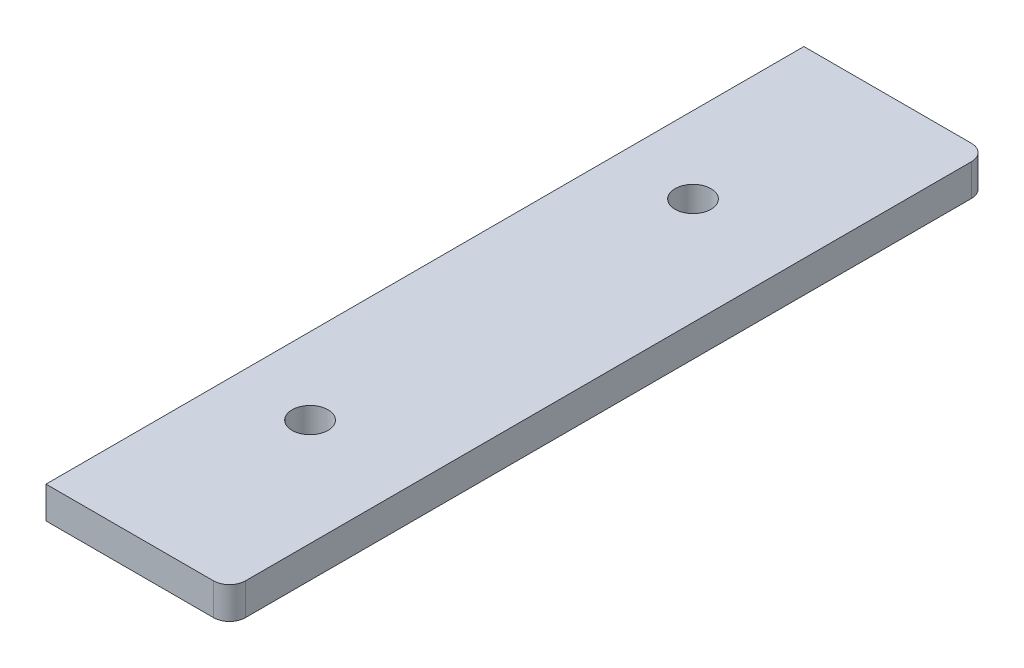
ISO-10303-21;
HEADER;
FILE_DESCRIPTION(('STEP AP214'),'2;1');
FILE_NAME('part.step','',(''),(''),'','','');
FILE_SCHEMA(('AUTOMOTIVE_DESIGN { 1 0 10303 214 1 1 1 1 }'));
ENDSEC;
DATA;
#1=APPLICATION_CONTEXT('core data for automotive mechanical design processes');
#2=APPLICATION_PROTOCOL_DEFINITION('international standard','automotive_design',2000,#1);
#3=PRODUCT_CONTEXT('',#1,'mechanical');
#4=PRODUCT('Part','Part','',(#3));
#5=PRODUCT_RELATED_PRODUCT_CATEGORY('part','',(#4));
#6=PRODUCT_DEFINITION_FORMATION('','',#4);
#7=PRODUCT_DEFINITION_CONTEXT('part definition',#1,'design');
#8=PRODUCT_DEFINITION('design','',#6,#7);
#9=PRODUCT_DEFINITION_SHAPE('','',#8);
#10=(LENGTH_UNIT() NAMED_UNIT(*) SI_UNIT(.MILLI.,.METRE.));
#11=(NAMED_UNIT(*) PLANE_ANGLE_UNIT() SI_UNIT($,.RADIAN.));
#12=(NAMED_UNIT(*) SI_UNIT($,.STERADIAN.) SOLID_ANGLE_UNIT());
#13=UNCERTAINTY_MEASURE_WITH_UNIT(LENGTH_MEASURE(1.E-05),#10,'distance_accuracy_value','');
#14=(GEOMETRIC_REPRESENTATION_CONTEXT(3) GLOBAL_UNCERTAINTY_ASSIGNED_CONTEXT((#13)) GLOBAL_UNIT_ASSIGNED_CONTEXT((#10,
#11,#12)) REPRESENTATION_CONTEXT('',''));
#15=CARTESIAN_POINT('',(0.,0.,0.));
#16=DIRECTION('',(0.,0.,1.));
#17=DIRECTION('',(1.,0.,0.));
#18=AXIS2_PLACEMENT_3D('',#15,#16,#17);
#19=CARTESIAN_POINT('',(0.,6.35,0.));
#20=DIRECTION('',(0.,-1.,0.));
#21=DIRECTION('',(0.,0.,-1.));
#22=AXIS2_PLACEMENT_3D('',#19,#20,#21);
#23=PLANE('',#22);
#24=DIRECTION('',(1.,0.,0.));
#25=VECTOR('',#24,1.);
#26=CARTESIAN_POINT('',(-18.25625,6.35,75.40625));
#27=LINE('',#26,#25);
#28=CARTESIAN_POINT('',(-18.25625,6.35,75.40625));
#29=VERTEX_POINT('',#28);
#30=CARTESIAN_POINT('',(15.08125,6.35,75.40625));
#31=VERTEX_POINT('',#30);
#32=EDGE_CURVE('E140',#29,#31,#27,.T.);
#33=ORIENTED_EDGE('',*,*,#32,.T.);
#34=CARTESIAN_POINT('',(15.08125,6.35,72.23125));
#35=DIRECTION('',(0.,-1.,0.));
#36=DIRECTION('',(0.,0.,-1.));
#37=AXIS2_PLACEMENT_3D('',#34,#35,#36);
#38=CIRCLE('',#37,3.175);
#39=CARTESIAN_POINT('',(18.25625,6.35,72.23125));
#40=VERTEX_POINT('',#39);
#41=EDGE_CURVE('E58',#31,#40,#38,.F.);
#42=ORIENTED_EDGE('',*,*,#41,.T.);
#43=DIRECTION('',(0.,0.,-1.));
#44=VECTOR('',#43,1.);
#45=CARTESIAN_POINT('',(18.25625,6.35,75.40625));
#46=LINE('',#45,#44);
#47=CARTESIAN_POINT('',(18.25625,6.35,-72.23125));
#48=VERTEX_POINT('',#47);
#49=EDGE_CURVE('E124',#40,#48,#46,.T.);
#50=ORIENTED_EDGE('',*,*,#49,.T.);
#51=CARTESIAN_POINT('',(15.08125,6.35,-72.23125));
#52=DIRECTION('',(0.,-1.,0.));
#53=DIRECTION('',(0.,0.,-1.));
#54=AXIS2_PLACEMENT_3D('',#51,#52,#53);
#55=CIRCLE('',#54,3.175);
#56=CARTESIAN_POINT('',(15.08125,6.35,-75.40625));
#57=VERTEX_POINT('',#56);
#58=EDGE_CURVE('E68',#48,#57,#55,.F.);
#59=ORIENTED_EDGE('',*,*,#58,.T.);
#60=DIRECTION('',(-1.,0.,0.));
#61=VECTOR('',#60,1.);
#62=CARTESIAN_POINT('',(-18.25625,6.35,-75.40625));
#63=LINE('',#62,#61);
#64=CARTESIAN_POINT('',(-18.25625,6.35,-75.40625));
#65=VERTEX_POINT('',#64);
#66=EDGE_CURVE('E115',#57,#65,#63,.T.);
#67=ORIENTED_EDGE('',*,*,#66,.T.);
#68=DIRECTION('',(0.,0.,1.));
#69=VECTOR('',#68,1.);
#70=CARTESIAN_POINT('',(-18.25625,6.35,75.40625));
#71=LINE('',#70,#69);
#72=EDGE_CURVE('E119',#65,#29,#71,.T.);
#73=ORIENTED_EDGE('',*,*,#72,.T.);
#74=EDGE_LOOP('',(#33,#42,#50,#59,#67,#73));
#75=FACE_BOUND('',#74,.T.);
#76=CARTESIAN_POINT('',(-3.01625000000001,6.35,-38.1));
#77=DIRECTION('',(0.,1.,0.));
#78=DIRECTION('',(0.,0.,1.));
#79=AXIS2_PLACEMENT_3D('',#76,#77,#78);
#80=CIRCLE('',#79,3.571875);
#81=CARTESIAN_POINT('',(-3.01625000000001,6.35,-34.528125));
#82=VERTEX_POINT('',#81);
#83=EDGE_CURVE('E152',#82,#82,#80,.T.);
#84=ORIENTED_EDGE('',*,*,#83,.F.);
#85=EDGE_LOOP('',(#84));
#86=FACE_BOUND('',#85,.T.);
#87=CARTESIAN_POINT('',(-3.01625,6.35,38.1));
#88=DIRECTION('',(0.,1.,0.));
#89=DIRECTION('',(0.,0.,1.));
#90=AXIS2_PLACEMENT_3D('',#87,#88,#89);
#91=CIRCLE('',#90,3.571875);
#92=CARTESIAN_POINT('',(-3.01625,6.35,41.671875));
#93=VERTEX_POINT('',#92);
#94=EDGE_CURVE('E219',#93,#93,#91,.T.);
#95=ORIENTED_EDGE('',*,*,#94,.F.);
#96=EDGE_LOOP('',(#95));
#97=FACE_BOUND('',#96,.T.);
#98=ADVANCED_FACE('F49',(#75,#86,#97),#23,.F.);
#99=CARTESIAN_POINT('',(0.,0.,0.));
#100=DIRECTION('',(0.,-1.,0.));
#101=DIRECTION('',(0.,0.,-1.));
#102=AXIS2_PLACEMENT_3D('',#99,#100,#101);
#103=PLANE('',#102);
#104=CARTESIAN_POINT('',(-3.01625000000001,0.,-38.1));
#105=DIRECTION('',(0.,1.,0.));
#106=DIRECTION('',(0.,0.,1.));
#107=AXIS2_PLACEMENT_3D('',#104,#105,#106);
#108=CIRCLE('',#107,3.571875);
#109=CARTESIAN_POINT('',(-3.01625000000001,0.,-34.528125));
#110=VERTEX_POINT('',#109);
#111=EDGE_CURVE('E226',#110,#110,#108,.T.);
#112=ORIENTED_EDGE('',*,*,#111,.T.);
#113=EDGE_LOOP('',(#112));
#114=FACE_BOUND('',#113,.T.);
#115=DIRECTION('',(0.,0.,-1.));
#116=VECTOR('',#115,1.);
#117=CARTESIAN_POINT('',(18.25625,0.,75.40625));
#118=LINE('',#117,#116);
#119=CARTESIAN_POINT('',(18.25625,0.,72.23125));
#120=VERTEX_POINT('',#119);
#121=CARTESIAN_POINT('',(18.25625,0.,-72.23125));
#122=VERTEX_POINT('',#121);
#123=EDGE_CURVE('E148',#120,#122,#118,.T.);
#124=ORIENTED_EDGE('',*,*,#123,.F.);
#125=CARTESIAN_POINT('',(15.08125,0.,72.23125));
#126=DIRECTION('',(0.,-1.,0.));
#127=DIRECTION('',(0.,0.,-1.));
#128=AXIS2_PLACEMENT_3D('',#125,#126,#127);
#129=CIRCLE('',#128,3.175);
#130=CARTESIAN_POINT('',(15.08125,0.,75.40625));
#131=VERTEX_POINT('',#130);
#132=EDGE_CURVE('E171',#120,#131,#129,.T.);
#133=ORIENTED_EDGE('',*,*,#132,.T.);
#134=DIRECTION('',(1.,0.,0.));
#135=VECTOR('',#134,1.);
#136=CARTESIAN_POINT('',(-18.25625,0.,75.40625));
#137=LINE('',#136,#135);
#138=CARTESIAN_POINT('',(-18.25625,0.,75.40625));
#139=VERTEX_POINT('',#138);
#140=EDGE_CURVE('E158',#139,#131,#137,.T.);
#141=ORIENTED_EDGE('',*,*,#140,.F.);
#142=DIRECTION('',(0.,0.,1.));
#143=VECTOR('',#142,1.);
#144=CARTESIAN_POINT('',(-18.25625,0.,75.40625));
#145=LINE('',#144,#143);
#146=CARTESIAN_POINT('',(-18.25625,0.,-75.40625));
#147=VERTEX_POINT('',#146);
#148=EDGE_CURVE('E155',#147,#139,#145,.T.);
#149=ORIENTED_EDGE('',*,*,#148,.F.);
#150=DIRECTION('',(-1.,0.,0.));
#151=VECTOR('',#150,1.);
#152=CARTESIAN_POINT('',(-18.25625,0.,-75.40625));
#153=LINE('',#152,#151);
#154=CARTESIAN_POINT('',(15.08125,0.,-75.40625));
#155=VERTEX_POINT('',#154);
#156=EDGE_CURVE('E130',#155,#147,#153,.T.);
#157=ORIENTED_EDGE('',*,*,#156,.F.);
#158=CARTESIAN_POINT('',(15.08125,0.,-72.23125));
#159=DIRECTION('',(0.,-1.,0.));
#160=DIRECTION('',(0.,0.,-1.));
#161=AXIS2_PLACEMENT_3D('',#158,#159,#160);
#162=CIRCLE('',#161,3.175);
#163=EDGE_CURVE('E168',#155,#122,#162,.T.);
#164=ORIENTED_EDGE('',*,*,#163,.T.);
#165=EDGE_LOOP('',(#124,#133,#141,#149,#157,#164));
#166=FACE_BOUND('',#165,.T.);
#167=CARTESIAN_POINT('',(-3.01625,0.,38.1));
#168=DIRECTION('',(0.,1.,0.));
#169=DIRECTION('',(0.,0.,1.));
#170=AXIS2_PLACEMENT_3D('',#167,#168,#169);
#171=CIRCLE('',#170,3.571875);
#172=CARTESIAN_POINT('',(-3.01625,0.,41.671875));
#173=VERTEX_POINT('',#172);
#174=EDGE_CURVE('E222',#173,#173,#171,.T.);
#175=ORIENTED_EDGE('',*,*,#174,.T.);
#176=EDGE_LOOP('',(#175));
#177=FACE_BOUND('',#176,.T.);
#178=ADVANCED_FACE('F189',(#114,#166,#177),#103,.T.);
#179=CARTESIAN_POINT('',(18.25625,6.35,75.40625));
#180=DIRECTION('',(-1.,0.,0.));
#181=DIRECTION('',(0.,0.,1.));
#182=AXIS2_PLACEMENT_3D('',#179,#180,#181);
#183=PLANE('',#182);
#184=ORIENTED_EDGE('',*,*,#49,.F.);
#185=DIRECTION('',(0.,-1.,0.));
#186=VECTOR('',#185,1.);
#187=CARTESIAN_POINT('',(18.25625,6.35,72.23125));
#188=LINE('',#187,#186);
#189=EDGE_CURVE('E164',#40,#120,#188,.T.);
#190=ORIENTED_EDGE('',*,*,#189,.T.);
#191=ORIENTED_EDGE('',*,*,#123,.T.);
#192=DIRECTION('',(0.,-1.,0.));
#193=VECTOR('',#192,1.);
#194=CARTESIAN_POINT('',(18.25625,6.35,-72.23125));
#195=LINE('',#194,#193);
#196=EDGE_CURVE('E134',#122,#48,#195,.F.);
#197=ORIENTED_EDGE('',*,*,#196,.T.);
#198=EDGE_LOOP('',(#184,#190,#191,#197));
#199=FACE_BOUND('',#198,.T.);
#200=ADVANCED_FACE('F183',(#199),#183,.F.);
#201=CARTESIAN_POINT('',(-18.25625,6.35,-75.40625));
#202=DIRECTION('',(0.,0.,1.));
#203=DIRECTION('',(1.,0.,0.));
#204=AXIS2_PLACEMENT_3D('',#201,#202,#203);
#205=PLANE('',#204);
#206=ORIENTED_EDGE('',*,*,#66,.F.);
#207=DIRECTION('',(0.,-1.,0.));
#208=VECTOR('',#207,1.);
#209=CARTESIAN_POINT('',(15.08125,6.35,-75.40625));
#210=LINE('',#209,#208);
#211=EDGE_CURVE('E12',#57,#155,#210,.T.);
#212=ORIENTED_EDGE('',*,*,#211,.T.);
#213=ORIENTED_EDGE('',*,*,#156,.T.);
#214=DIRECTION('',(0.,-1.,0.));
#215=VECTOR('',#214,1.);
#216=CARTESIAN_POINT('',(-18.25625,6.35,-75.40625));
#217=LINE('',#216,#215);
#218=EDGE_CURVE('E127',#65,#147,#217,.T.);
#219=ORIENTED_EDGE('',*,*,#218,.F.);
#220=EDGE_LOOP('',(#206,#212,#213,#219));
#221=FACE_BOUND('',#220,.T.);
#222=ADVANCED_FACE('F128',(#221),#205,.F.);
#223=CARTESIAN_POINT('',(-18.25625,6.35,75.40625));
#224=DIRECTION('',(1.,0.,0.));
#225=DIRECTION('',(0.,0.,-1.));
#226=AXIS2_PLACEMENT_3D('',#223,#224,#225);
#227=PLANE('',#226);
#228=ORIENTED_EDGE('',*,*,#148,.T.);
#229=DIRECTION('',(0.,-1.,0.));
#230=VECTOR('',#229,1.);
#231=CARTESIAN_POINT('',(-18.25625,6.35,75.40625));
#232=LINE('',#231,#230);
#233=EDGE_CURVE('E135',#29,#139,#232,.T.);
#234=ORIENTED_EDGE('',*,*,#233,.F.);
#235=ORIENTED_EDGE('',*,*,#72,.F.);
#236=ORIENTED_EDGE('',*,*,#218,.T.);
#237=EDGE_LOOP('',(#228,#234,#235,#236));
#238=FACE_BOUND('',#237,.T.);
#239=ADVANCED_FACE('F137',(#238),#227,.F.);
#240=CARTESIAN_POINT('',(-18.25625,6.35,75.40625));
#241=DIRECTION('',(0.,0.,-1.));
#242=DIRECTION('',(-1.,0.,0.));
#243=AXIS2_PLACEMENT_3D('',#240,#241,#242);
#244=PLANE('',#243);
#245=ORIENTED_EDGE('',*,*,#140,.T.);
#246=DIRECTION('',(0.,-1.,0.));
#247=VECTOR('',#246,1.);
#248=CARTESIAN_POINT('',(15.08125,6.35,75.40625));
#249=LINE('',#248,#247);
#250=EDGE_CURVE('E79',#131,#31,#249,.F.);
#251=ORIENTED_EDGE('',*,*,#250,.T.);
#252=ORIENTED_EDGE('',*,*,#32,.F.);
#253=ORIENTED_EDGE('',*,*,#233,.T.);
#254=EDGE_LOOP('',(#245,#251,#252,#253));
#255=FACE_BOUND('',#254,.T.);
#256=ADVANCED_FACE('F191',(#255),#244,.F.);
#257=CARTESIAN_POINT('',(-3.01625000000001,6.35,-38.1));
#258=DIRECTION('',(0.,-1.,0.));
#259=DIRECTION('',(0.,0.,-1.));
#260=AXIS2_PLACEMENT_3D('',#257,#258,#259);
#261=CYLINDRICAL_SURFACE('',#260,3.571875);
#262=ORIENTED_EDGE('',*,*,#83,.T.);
#263=EDGE_LOOP('',(#262));
#264=FACE_BOUND('',#263,.T.);
#265=ORIENTED_EDGE('',*,*,#111,.F.);
#266=EDGE_LOOP('',(#265));
#267=FACE_BOUND('',#266,.T.);
#268=ADVANCED_FACE('F193',(#264,#267),#261,.F.);
#269=CARTESIAN_POINT('',(-3.01625,6.35,38.1));
#270=DIRECTION('',(0.,-1.,0.));
#271=DIRECTION('',(0.,0.,-1.));
#272=AXIS2_PLACEMENT_3D('',#269,#270,#271);
#273=CYLINDRICAL_SURFACE('',#272,3.571875);
#274=ORIENTED_EDGE('',*,*,#94,.T.);
#275=EDGE_LOOP('',(#274));
#276=FACE_BOUND('',#275,.T.);
#277=ORIENTED_EDGE('',*,*,#174,.F.);
#278=EDGE_LOOP('',(#277));
#279=FACE_BOUND('',#278,.T.);
#280=ADVANCED_FACE('F199',(#276,#279),#273,.F.);
#281=CARTESIAN_POINT('',(15.08125,6.35,72.23125));
#282=DIRECTION('',(0.,-1.,0.));
#283=DIRECTION('',(0.,0.,-1.));
#284=AXIS2_PLACEMENT_3D('',#281,#282,#283);
#285=CYLINDRICAL_SURFACE('',#284,3.175);
#286=ORIENTED_EDGE('',*,*,#41,.F.);
#287=ORIENTED_EDGE('',*,*,#250,.F.);
#288=ORIENTED_EDGE('',*,*,#132,.F.);
#289=ORIENTED_EDGE('',*,*,#189,.F.);
#290=EDGE_LOOP('',(#286,#287,#288,#289));
#291=FACE_BOUND('',#290,.T.);
#292=ADVANCED_FACE('F186',(#291),#285,.T.);
#293=CARTESIAN_POINT('',(15.08125,6.35,-72.23125));
#294=DIRECTION('',(0.,-1.,0.));
#295=DIRECTION('',(0.,0.,-1.));
#296=AXIS2_PLACEMENT_3D('',#293,#294,#295);
#297=CYLINDRICAL_SURFACE('',#296,3.175);
#298=ORIENTED_EDGE('',*,*,#58,.F.);
#299=ORIENTED_EDGE('',*,*,#196,.F.);
#300=ORIENTED_EDGE('',*,*,#163,.F.);
#301=ORIENTED_EDGE('',*,*,#211,.F.);
#302=EDGE_LOOP('',(#298,#299,#300,#301));
#303=FACE_BOUND('',#302,.T.);
#304=ADVANCED_FACE('F51',(#303),#297,.T.);
#305=CLOSED_SHELL('',(#98,#178,#200,#222,#239,#256,#268,#280,#292,#304));
#306=MANIFOLD_SOLID_BREP('B2',#305);
#307=ADVANCED_BREP_SHAPE_REPRESENTATION('',(#18,#306),#14);
#308=SHAPE_DEFINITION_REPRESENTATION(#9,#307);
ENDSEC;
END-ISO-10303-21;
